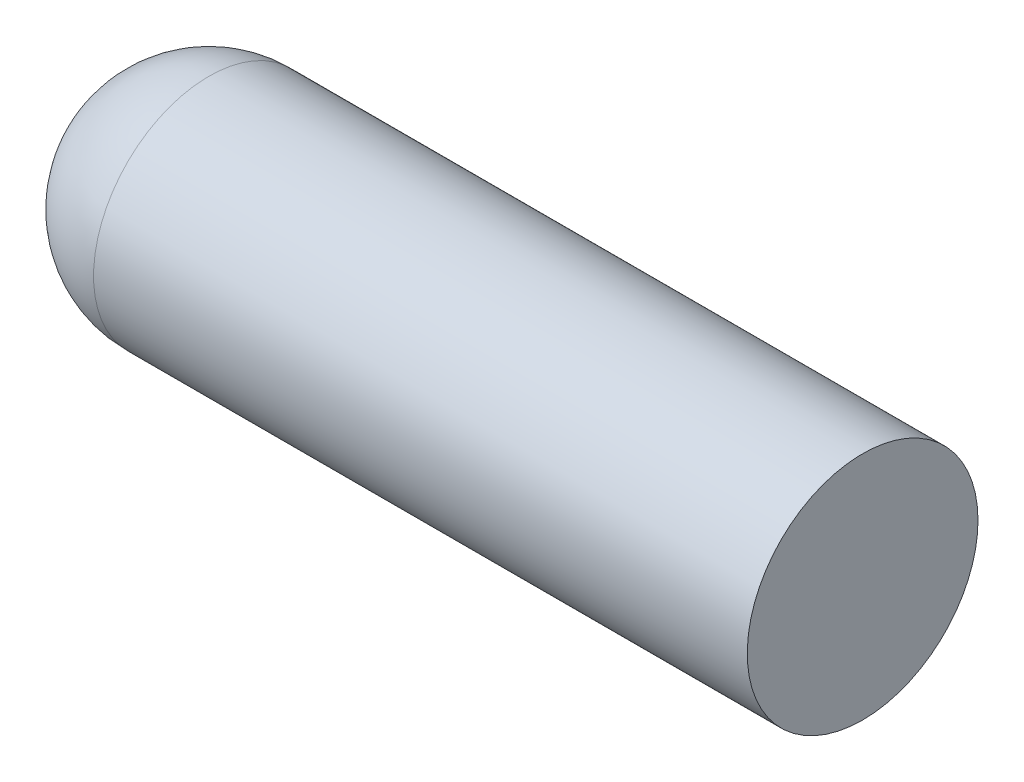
ISO-10303-21;
HEADER;
FILE_DESCRIPTION(('STEP AP214'),'2;1');
FILE_NAME('part.step','',(''),(''),'','','');
FILE_SCHEMA(('AUTOMOTIVE_DESIGN { 1 0 10303 214 1 1 1 1 }'));
ENDSEC;
DATA;
#1=APPLICATION_CONTEXT('core data for automotive mechanical design processes');
#2=APPLICATION_PROTOCOL_DEFINITION('international standard','automotive_design',2000,#1);
#3=PRODUCT_CONTEXT('',#1,'mechanical');
#4=PRODUCT('Part','Part','',(#3));
#5=PRODUCT_RELATED_PRODUCT_CATEGORY('part','',(#4));
#6=PRODUCT_DEFINITION_FORMATION('','',#4);
#7=PRODUCT_DEFINITION_CONTEXT('part definition',#1,'design');
#8=PRODUCT_DEFINITION('design','',#6,#7);
#9=PRODUCT_DEFINITION_SHAPE('','',#8);
#10=(LENGTH_UNIT() NAMED_UNIT(*) SI_UNIT(.MILLI.,.METRE.));
#11=(NAMED_UNIT(*) PLANE_ANGLE_UNIT() SI_UNIT($,.RADIAN.));
#12=(NAMED_UNIT(*) SI_UNIT($,.STERADIAN.) SOLID_ANGLE_UNIT());
#13=UNCERTAINTY_MEASURE_WITH_UNIT(LENGTH_MEASURE(1.E-05),#10,'distance_accuracy_value','');
#14=(GEOMETRIC_REPRESENTATION_CONTEXT(3) GLOBAL_UNCERTAINTY_ASSIGNED_CONTEXT((#13)) GLOBAL_UNIT_ASSIGNED_CONTEXT((#10,
#11,#12)) REPRESENTATION_CONTEXT('',''));
#15=CARTESIAN_POINT('',(0.,0.,0.));
#16=DIRECTION('',(0.,0.,1.));
#17=DIRECTION('',(1.,0.,0.));
#18=AXIS2_PLACEMENT_3D('',#15,#16,#17);
#19=CARTESIAN_POINT('',(-9.95,39.8,0.));
#20=DIRECTION('',(1.,0.,0.));
#21=DIRECTION('',(0.,1.,0.));
#22=AXIS2_PLACEMENT_3D('',#19,#20,#21);
#23=CYLINDRICAL_SURFACE('',#22,1.4925);
#24=CARTESIAN_POINT('',(-8.4575,39.8,0.));
#25=DIRECTION('',(1.,0.,0.));
#26=DIRECTION('',(0.,0.,-1.));
#27=AXIS2_PLACEMENT_3D('',#24,#25,#26);
#28=CIRCLE('',#27,1.4925);
#29=CARTESIAN_POINT('',(-8.4575,39.8,-1.4925));
#30=VERTEX_POINT('',#29);
#31=EDGE_CURVE('E10',#30,#30,#28,.T.);
#32=ORIENTED_EDGE('',*,*,#31,.T.);
#33=EDGE_LOOP('',(#32));
#34=FACE_BOUND('',#33,.T.);
#35=CARTESIAN_POINT('',(0.,39.8,0.));
#36=DIRECTION('',(-1.,0.,0.));
#37=DIRECTION('',(0.,-1.,0.));
#38=AXIS2_PLACEMENT_3D('',#35,#36,#37);
#39=CIRCLE('',#38,1.4925);
#40=CARTESIAN_POINT('',(0.,38.3075,0.));
#41=VERTEX_POINT('',#40);
#42=EDGE_CURVE('E21',#41,#41,#39,.T.);
#43=ORIENTED_EDGE('',*,*,#42,.T.);
#44=EDGE_LOOP('',(#43));
#45=FACE_BOUND('',#44,.T.);
#46=ADVANCED_FACE('F14',(#34,#45),#23,.T.);
#47=CARTESIAN_POINT('',(0.,39.8,0.));
#48=DIRECTION('',(-1.,0.,0.));
#49=DIRECTION('',(0.,-1.,0.));
#50=AXIS2_PLACEMENT_3D('',#47,#48,#49);
#51=PLANE('',#50);
#52=ORIENTED_EDGE('',*,*,#42,.F.);
#53=EDGE_LOOP('',(#52));
#54=FACE_BOUND('',#53,.T.);
#55=ADVANCED_FACE('F47',(#54),#51,.F.);
#56=CARTESIAN_POINT('',(-8.4575,39.8,0.));
#57=DIRECTION('',(0.,0.,1.));
#58=DIRECTION('',(1.,0.,0.));
#59=AXIS2_PLACEMENT_3D('',#56,#57,#58);
#60=SPHERICAL_SURFACE('',#59,1.4925);
#61=CARTESIAN_POINT('',(-8.4575,39.8,0.));
#62=DIRECTION('',(1.,0.,0.));
#63=DIRECTION('',(0.,0.,-1.));
#64=AXIS2_PLACEMENT_3D('',#61,#62,#63);
#65=SPHERICAL_SURFACE('',#64,1.4925);
#66=ORIENTED_EDGE('',*,*,#31,.F.);
#67=EDGE_LOOP('',(#66));
#68=FACE_BOUND('',#67,.T.);
#69=ADVANCED_FACE('F49',(#68),#65,.T.);
#70=CLOSED_SHELL('',(#46,#55,#69));
#71=MANIFOLD_SOLID_BREP('B1',#70);
#72=ADVANCED_BREP_SHAPE_REPRESENTATION('',(#18,#71),#14);
#73=SHAPE_DEFINITION_REPRESENTATION(#9,#72);
ENDSEC;
END-ISO-10303-21;
